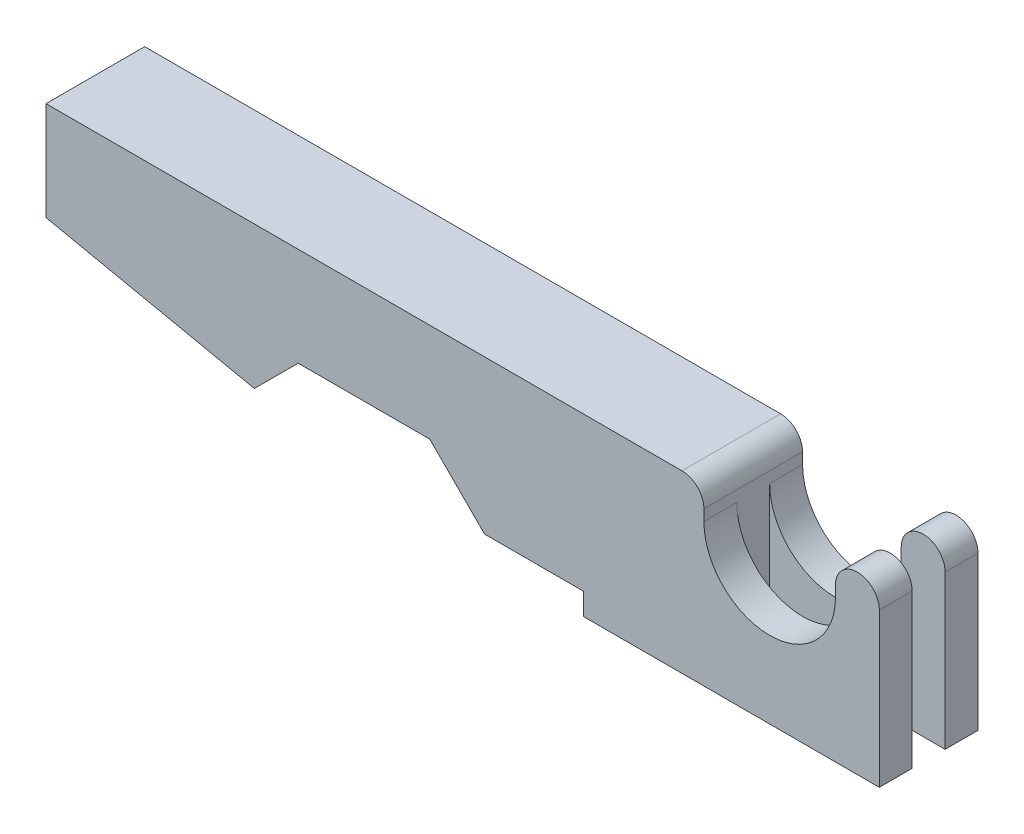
ISO-10303-21;
HEADER;
FILE_DESCRIPTION(('STEP AP214'),'2;1');
FILE_NAME('part.step','',(''),(''),'','','');
FILE_SCHEMA(('AUTOMOTIVE_DESIGN { 1 0 10303 214 1 1 1 1 }'));
ENDSEC;
DATA;
#1=APPLICATION_CONTEXT('core data for automotive mechanical design processes');
#2=APPLICATION_PROTOCOL_DEFINITION('international standard','automotive_design',2000,#1);
#3=PRODUCT_CONTEXT('',#1,'mechanical');
#4=PRODUCT('Part','Part','',(#3));
#5=PRODUCT_RELATED_PRODUCT_CATEGORY('part','',(#4));
#6=PRODUCT_DEFINITION_FORMATION('','',#4);
#7=PRODUCT_DEFINITION_CONTEXT('part definition',#1,'design');
#8=PRODUCT_DEFINITION('design','',#6,#7);
#9=PRODUCT_DEFINITION_SHAPE('','',#8);
#10=(LENGTH_UNIT() NAMED_UNIT(*) SI_UNIT(.MILLI.,.METRE.));
#11=(NAMED_UNIT(*) PLANE_ANGLE_UNIT() SI_UNIT($,.RADIAN.));
#12=(NAMED_UNIT(*) SI_UNIT($,.STERADIAN.) SOLID_ANGLE_UNIT());
#13=UNCERTAINTY_MEASURE_WITH_UNIT(LENGTH_MEASURE(1.E-05),#10,'distance_accuracy_value','');
#14=(GEOMETRIC_REPRESENTATION_CONTEXT(3) GLOBAL_UNCERTAINTY_ASSIGNED_CONTEXT((#13)) GLOBAL_UNIT_ASSIGNED_CONTEXT((#10,
#11,#12)) REPRESENTATION_CONTEXT('',''));
#15=CARTESIAN_POINT('',(0.,0.,0.));
#16=DIRECTION('',(0.,0.,1.));
#17=DIRECTION('',(1.,0.,0.));
#18=AXIS2_PLACEMENT_3D('',#15,#16,#17);
#19=CARTESIAN_POINT('',(0.,0.,2.25));
#20=DIRECTION('',(-1.,0.,0.));
#21=DIRECTION('',(0.,0.,1.));
#22=AXIS2_PLACEMENT_3D('',#19,#20,#21);
#23=PLANE('',#22);
#24=DIRECTION('',(0.,0.,-1.));
#25=VECTOR('',#24,1.);
#26=CARTESIAN_POINT('',(0.,7.,2.25));
#27=LINE('',#26,#25);
#28=CARTESIAN_POINT('',(0.,7.,-0.75));
#29=VERTEX_POINT('',#28);
#30=CARTESIAN_POINT('',(0.,7.,-2.25));
#31=VERTEX_POINT('',#30);
#32=EDGE_CURVE('E216',#29,#31,#27,.T.);
#33=ORIENTED_EDGE('',*,*,#32,.F.);
#34=DIRECTION('',(0.,-1.,0.));
#35=VECTOR('',#34,1.);
#36=CARTESIAN_POINT('',(0.,8.,-0.75));
#37=LINE('',#36,#35);
#38=CARTESIAN_POINT('',(0.,0.,-0.75));
#39=VERTEX_POINT('',#38);
#40=EDGE_CURVE('E327',#29,#39,#37,.T.);
#41=ORIENTED_EDGE('',*,*,#40,.T.);
#42=DIRECTION('',(0.,0.,-1.));
#43=VECTOR('',#42,1.);
#44=CARTESIAN_POINT('',(0.,0.,2.25));
#45=LINE('',#44,#43);
#46=CARTESIAN_POINT('',(0.,0.,-2.25));
#47=VERTEX_POINT('',#46);
#48=EDGE_CURVE('E208',#39,#47,#45,.T.);
#49=ORIENTED_EDGE('',*,*,#48,.T.);
#50=DIRECTION('',(0.,1.,0.));
#51=VECTOR('',#50,1.);
#52=CARTESIAN_POINT('',(0.,0.,-2.25));
#53=LINE('',#52,#51);
#54=EDGE_CURVE('E282',#47,#31,#53,.T.);
#55=ORIENTED_EDGE('',*,*,#54,.T.);
#56=EDGE_LOOP('',(#33,#41,#49,#55));
#57=FACE_BOUND('',#56,.T.);
#58=ADVANCED_FACE('F37',(#57),#23,.F.);
#59=CARTESIAN_POINT('',(-1.,7.,2.25));
#60=DIRECTION('',(0.,0.,-1.));
#61=DIRECTION('',(-1.,0.,0.));
#62=AXIS2_PLACEMENT_3D('',#59,#60,#61);
#63=CYLINDRICAL_SURFACE('',#62,1.);
#64=CARTESIAN_POINT('',(-1.,7.,-0.75));
#65=DIRECTION('',(0.,0.,-1.));
#66=DIRECTION('',(-1.,0.,0.));
#67=AXIS2_PLACEMENT_3D('',#64,#65,#66);
#68=CIRCLE('',#67,1.);
#69=CARTESIAN_POINT('',(-2.,7.,-0.750000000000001));
#70=VERTEX_POINT('',#69);
#71=EDGE_CURVE('E288',#70,#29,#68,.T.);
#72=ORIENTED_EDGE('',*,*,#71,.T.);
#73=ORIENTED_EDGE('',*,*,#32,.T.);
#74=CARTESIAN_POINT('',(-1.,7.,-2.25));
#75=DIRECTION('',(0.,0.,1.));
#76=DIRECTION('',(1.,0.,0.));
#77=AXIS2_PLACEMENT_3D('',#74,#75,#76);
#78=CIRCLE('',#77,1.);
#79=CARTESIAN_POINT('',(-2.,7.,-2.25));
#80=VERTEX_POINT('',#79);
#81=EDGE_CURVE('E279',#31,#80,#78,.T.);
#82=ORIENTED_EDGE('',*,*,#81,.T.);
#83=DIRECTION('',(0.,0.,-1.));
#84=VECTOR('',#83,1.);
#85=CARTESIAN_POINT('',(-2.,7.,2.25));
#86=LINE('',#85,#84);
#87=EDGE_CURVE('E220',#70,#80,#86,.T.);
#88=ORIENTED_EDGE('',*,*,#87,.F.);
#89=EDGE_LOOP('',(#72,#73,#82,#88));
#90=FACE_BOUND('',#89,.T.);
#91=ADVANCED_FACE('F346',(#90),#63,.T.);
#92=CARTESIAN_POINT('',(-2.,7.,2.25));
#93=DIRECTION('',(1.,0.,0.));
#94=DIRECTION('',(0.,1.,0.));
#95=AXIS2_PLACEMENT_3D('',#92,#93,#94);
#96=PLANE('',#95);
#97=DIRECTION('',(0.,0.,-1.));
#98=VECTOR('',#97,1.);
#99=CARTESIAN_POINT('',(-2.,6.5,2.25));
#100=LINE('',#99,#98);
#101=CARTESIAN_POINT('',(-2.,6.5,-0.75));
#102=VERTEX_POINT('',#101);
#103=CARTESIAN_POINT('',(-2.,6.5,-2.25));
#104=VERTEX_POINT('',#103);
#105=EDGE_CURVE('E224',#102,#104,#100,.T.);
#106=ORIENTED_EDGE('',*,*,#105,.F.);
#107=DIRECTION('',(0.,1.,0.));
#108=VECTOR('',#107,1.);
#109=CARTESIAN_POINT('',(-2.,7.,-0.750000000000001));
#110=LINE('',#109,#108);
#111=EDGE_CURVE('E315',#102,#70,#110,.T.);
#112=ORIENTED_EDGE('',*,*,#111,.T.);
#113=ORIENTED_EDGE('',*,*,#87,.T.);
#114=DIRECTION('',(0.,-1.,0.));
#115=VECTOR('',#114,1.);
#116=CARTESIAN_POINT('',(-2.,7.,-2.25));
#117=LINE('',#116,#115);
#118=EDGE_CURVE('E276',#80,#104,#117,.T.);
#119=ORIENTED_EDGE('',*,*,#118,.T.);
#120=EDGE_LOOP('',(#106,#112,#113,#119));
#121=FACE_BOUND('',#120,.T.);
#122=ADVANCED_FACE('F351',(#121),#96,.F.);
#123=CARTESIAN_POINT('',(-5.,6.5,2.25));
#124=DIRECTION('',(0.,0.,-1.));
#125=DIRECTION('',(-1.,0.,0.));
#126=AXIS2_PLACEMENT_3D('',#123,#124,#125);
#127=CYLINDRICAL_SURFACE('',#126,3.);
#128=DIRECTION('',(0.,0.,-1.));
#129=VECTOR('',#128,1.);
#130=CARTESIAN_POINT('',(-8.,6.5,2.25));
#131=LINE('',#130,#129);
#132=CARTESIAN_POINT('',(-8.,6.5,-0.750000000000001));
#133=VERTEX_POINT('',#132);
#134=CARTESIAN_POINT('',(-8.,6.5,-2.25));
#135=VERTEX_POINT('',#134);
#136=EDGE_CURVE('E228',#133,#135,#131,.T.);
#137=ORIENTED_EDGE('',*,*,#136,.F.);
#138=CARTESIAN_POINT('',(-5.,6.5,-0.750000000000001));
#139=DIRECTION('',(0.,0.,-1.));
#140=DIRECTION('',(-1.,0.,0.));
#141=AXIS2_PLACEMENT_3D('',#138,#139,#140);
#142=CIRCLE('',#141,3.);
#143=EDGE_CURVE('E318',#133,#102,#142,.F.);
#144=ORIENTED_EDGE('',*,*,#143,.T.);
#145=ORIENTED_EDGE('',*,*,#105,.T.);
#146=CARTESIAN_POINT('',(-5.,6.5,-2.25));
#147=DIRECTION('',(0.,0.,-1.));
#148=DIRECTION('',(1.,0.,0.));
#149=AXIS2_PLACEMENT_3D('',#146,#147,#148);
#150=CIRCLE('',#149,3.);
#151=EDGE_CURVE('E273',#104,#135,#150,.T.);
#152=ORIENTED_EDGE('',*,*,#151,.T.);
#153=EDGE_LOOP('',(#137,#144,#145,#152));
#154=FACE_BOUND('',#153,.T.);
#155=ADVANCED_FACE('F354',(#154),#127,.F.);
#156=CARTESIAN_POINT('',(-13.5,0.,2.25));
#157=DIRECTION('',(0.,1.,0.));
#158=DIRECTION('',(0.,0.,1.));
#159=AXIS2_PLACEMENT_3D('',#156,#157,#158);
#160=PLANE('',#159);
#161=ORIENTED_EDGE('',*,*,#48,.F.);
#162=DIRECTION('',(1.,0.,0.));
#163=VECTOR('',#162,1.);
#164=CARTESIAN_POINT('',(0.,0.,-0.75));
#165=LINE('',#164,#163);
#166=CARTESIAN_POINT('',(-8.,0.,-0.750000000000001));
#167=VERTEX_POINT('',#166);
#168=EDGE_CURVE('E192',#167,#39,#165,.T.);
#169=ORIENTED_EDGE('',*,*,#168,.F.);
#170=DIRECTION('',(0.,0.,-1.));
#171=VECTOR('',#170,1.);
#172=CARTESIAN_POINT('',(-8.,0.,0.749999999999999));
#173=LINE('',#172,#171);
#174=CARTESIAN_POINT('',(-8.,0.,0.749999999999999));
#175=VERTEX_POINT('',#174);
#176=EDGE_CURVE('E202',#175,#167,#173,.T.);
#177=ORIENTED_EDGE('',*,*,#176,.F.);
#178=DIRECTION('',(-1.,0.,0.));
#179=VECTOR('',#178,1.);
#180=CARTESIAN_POINT('',(0.,0.,0.75));
#181=LINE('',#180,#179);
#182=CARTESIAN_POINT('',(0.,0.,0.75));
#183=VERTEX_POINT('',#182);
#184=EDGE_CURVE('E183',#183,#175,#181,.T.);
#185=ORIENTED_EDGE('',*,*,#184,.F.);
#186=CARTESIAN_POINT('',(0.,0.,2.25));
#187=VERTEX_POINT('',#186);
#188=EDGE_CURVE('E199',#187,#183,#45,.T.);
#189=ORIENTED_EDGE('',*,*,#188,.F.);
#190=DIRECTION('',(1.,0.,0.));
#191=VECTOR('',#190,1.);
#192=CARTESIAN_POINT('',(-13.5,0.,2.25));
#193=LINE('',#192,#191);
#194=CARTESIAN_POINT('',(-13.5,0.,2.25));
#195=VERTEX_POINT('',#194);
#196=EDGE_CURVE('E256',#195,#187,#193,.T.);
#197=ORIENTED_EDGE('',*,*,#196,.F.);
#198=DIRECTION('',(0.,0.,-1.));
#199=VECTOR('',#198,1.);
#200=CARTESIAN_POINT('',(-13.5,0.,2.25));
#201=LINE('',#200,#199);
#202=CARTESIAN_POINT('',(-13.5,0.,-2.25));
#203=VERTEX_POINT('',#202);
#204=EDGE_CURVE('E250',#195,#203,#201,.T.);
#205=ORIENTED_EDGE('',*,*,#204,.T.);
#206=DIRECTION('',(1.,0.,0.));
#207=VECTOR('',#206,1.);
#208=CARTESIAN_POINT('',(-13.5,0.,-2.25));
#209=LINE('',#208,#207);
#210=EDGE_CURVE('E285',#203,#47,#209,.T.);
#211=ORIENTED_EDGE('',*,*,#210,.T.);
#212=EDGE_LOOP('',(#161,#169,#177,#185,#189,#197,#205,#211));
#213=FACE_BOUND('',#212,.T.);
#214=ADVANCED_FACE('F197',(#213),#160,.F.);
#215=ORIENTED_EDGE('',*,*,#188,.T.);
#216=DIRECTION('',(0.,-1.,0.));
#217=VECTOR('',#216,1.);
#218=CARTESIAN_POINT('',(0.,8.,0.75));
#219=LINE('',#218,#217);
#220=CARTESIAN_POINT('',(0.,7.,0.75));
#221=VERTEX_POINT('',#220);
#222=EDGE_CURVE('E180',#221,#183,#219,.T.);
#223=ORIENTED_EDGE('',*,*,#222,.F.);
#224=CARTESIAN_POINT('',(0.,7.,2.25));
#225=VERTEX_POINT('',#224);
#226=EDGE_CURVE('E212',#225,#221,#27,.T.);
#227=ORIENTED_EDGE('',*,*,#226,.F.);
#228=DIRECTION('',(0.,1.,0.));
#229=VECTOR('',#228,1.);
#230=CARTESIAN_POINT('',(0.,0.,2.25));
#231=LINE('',#230,#229);
#232=EDGE_CURVE('E205',#187,#225,#231,.T.);
#233=ORIENTED_EDGE('',*,*,#232,.F.);
#234=EDGE_LOOP('',(#215,#223,#227,#233));
#235=FACE_BOUND('',#234,.T.);
#236=ADVANCED_FACE('F204',(#235),#23,.F.);
#237=ORIENTED_EDGE('',*,*,#226,.T.);
#238=CARTESIAN_POINT('',(-1.,7.,0.75));
#239=DIRECTION('',(0.,0.,1.));
#240=DIRECTION('',(1.,0.,0.));
#241=AXIS2_PLACEMENT_3D('',#238,#239,#240);
#242=CIRCLE('',#241,1.);
#243=CARTESIAN_POINT('',(-2.,7.,0.75));
#244=VERTEX_POINT('',#243);
#245=EDGE_CURVE('E186',#221,#244,#242,.T.);
#246=ORIENTED_EDGE('',*,*,#245,.T.);
#247=CARTESIAN_POINT('',(-2.,7.,2.25));
#248=VERTEX_POINT('',#247);
#249=EDGE_CURVE('E217',#248,#244,#86,.T.);
#250=ORIENTED_EDGE('',*,*,#249,.F.);
#251=CARTESIAN_POINT('',(-1.,7.,2.25));
#252=DIRECTION('',(0.,0.,1.));
#253=DIRECTION('',(1.,0.,0.));
#254=AXIS2_PLACEMENT_3D('',#251,#252,#253);
#255=CIRCLE('',#254,1.);
#256=EDGE_CURVE('E310',#225,#248,#255,.T.);
#257=ORIENTED_EDGE('',*,*,#256,.F.);
#258=EDGE_LOOP('',(#237,#246,#250,#257));
#259=FACE_BOUND('',#258,.T.);
#260=ADVANCED_FACE('F416',(#259),#63,.T.);
#261=ORIENTED_EDGE('',*,*,#249,.T.);
#262=DIRECTION('',(0.,-1.,0.));
#263=VECTOR('',#262,1.);
#264=CARTESIAN_POINT('',(-2.,7.,0.75));
#265=LINE('',#264,#263);
#266=CARTESIAN_POINT('',(-2.,6.5,0.75));
#267=VERTEX_POINT('',#266);
#268=EDGE_CURVE('E322',#244,#267,#265,.T.);
#269=ORIENTED_EDGE('',*,*,#268,.T.);
#270=CARTESIAN_POINT('',(-2.,6.5,2.25));
#271=VERTEX_POINT('',#270);
#272=EDGE_CURVE('E221',#271,#267,#100,.T.);
#273=ORIENTED_EDGE('',*,*,#272,.F.);
#274=DIRECTION('',(0.,-1.,0.));
#275=VECTOR('',#274,1.);
#276=CARTESIAN_POINT('',(-2.,7.,2.25));
#277=LINE('',#276,#275);
#278=EDGE_CURVE('E308',#248,#271,#277,.T.);
#279=ORIENTED_EDGE('',*,*,#278,.F.);
#280=EDGE_LOOP('',(#261,#269,#273,#279));
#281=FACE_BOUND('',#280,.T.);
#282=ADVANCED_FACE('F422',(#281),#96,.F.);
#283=ORIENTED_EDGE('',*,*,#272,.T.);
#284=CARTESIAN_POINT('',(-5.,6.5,0.749999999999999));
#285=DIRECTION('',(0.,0.,1.));
#286=DIRECTION('',(1.,0.,0.));
#287=AXIS2_PLACEMENT_3D('',#284,#285,#286);
#288=CIRCLE('',#287,3.);
#289=CARTESIAN_POINT('',(-8.,6.5,0.749999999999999));
#290=VERTEX_POINT('',#289);
#291=EDGE_CURVE('E325',#267,#290,#288,.F.);
#292=ORIENTED_EDGE('',*,*,#291,.T.);
#293=CARTESIAN_POINT('',(-8.,6.5,2.25));
#294=VERTEX_POINT('',#293);
#295=EDGE_CURVE('E225',#294,#290,#131,.T.);
#296=ORIENTED_EDGE('',*,*,#295,.F.);
#297=CARTESIAN_POINT('',(-5.,6.5,2.25));
#298=DIRECTION('',(0.,0.,-1.));
#299=DIRECTION('',(1.,0.,0.));
#300=AXIS2_PLACEMENT_3D('',#297,#298,#299);
#301=CIRCLE('',#300,3.);
#302=EDGE_CURVE('E306',#271,#294,#301,.T.);
#303=ORIENTED_EDGE('',*,*,#302,.F.);
#304=EDGE_LOOP('',(#283,#292,#296,#303));
#305=FACE_BOUND('',#304,.T.);
#306=ADVANCED_FACE('F428',(#305),#127,.F.);
#307=CARTESIAN_POINT('',(-8.,8.,2.25));
#308=DIRECTION('',(-1.,0.,0.));
#309=DIRECTION('',(0.,0.,1.));
#310=AXIS2_PLACEMENT_3D('',#307,#308,#309);
#311=PLANE('',#310);
#312=DIRECTION('',(0.,1.,0.));
#313=VECTOR('',#312,1.);
#314=CARTESIAN_POINT('',(-8.,8.,-2.25));
#315=LINE('',#314,#313);
#316=CARTESIAN_POINT('',(-8.,7.,-2.25));
#317=VERTEX_POINT('',#316);
#318=EDGE_CURVE('E271',#135,#317,#315,.T.);
#319=ORIENTED_EDGE('',*,*,#318,.T.);
#320=DIRECTION('',(0.,0.,-1.));
#321=VECTOR('',#320,1.);
#322=CARTESIAN_POINT('',(-8.,7.,2.25));
#323=LINE('',#322,#321);
#324=CARTESIAN_POINT('',(-8.,7.,2.25));
#325=VERTEX_POINT('',#324);
#326=EDGE_CURVE('E45',#317,#325,#323,.F.);
#327=ORIENTED_EDGE('',*,*,#326,.T.);
#328=DIRECTION('',(0.,1.,0.));
#329=VECTOR('',#328,1.);
#330=CARTESIAN_POINT('',(-8.,8.,2.25));
#331=LINE('',#330,#329);
#332=EDGE_CURVE('E304',#294,#325,#331,.T.);
#333=ORIENTED_EDGE('',*,*,#332,.F.);
#334=ORIENTED_EDGE('',*,*,#295,.T.);
#335=DIRECTION('',(0.,-1.,0.));
#336=VECTOR('',#335,1.);
#337=CARTESIAN_POINT('',(-8.,8.,0.749999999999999));
#338=LINE('',#337,#336);
#339=EDGE_CURVE('E191',#290,#175,#338,.T.);
#340=ORIENTED_EDGE('',*,*,#339,.T.);
#341=ORIENTED_EDGE('',*,*,#176,.T.);
#342=DIRECTION('',(0.,-1.,0.));
#343=VECTOR('',#342,1.);
#344=CARTESIAN_POINT('',(-8.,8.,-0.750000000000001));
#345=LINE('',#344,#343);
#346=EDGE_CURVE('E330',#133,#167,#345,.T.);
#347=ORIENTED_EDGE('',*,*,#346,.F.);
#348=ORIENTED_EDGE('',*,*,#136,.T.);
#349=EDGE_LOOP('',(#319,#327,#333,#334,#340,#341,#347,#348));
#350=FACE_BOUND('',#349,.T.);
#351=ADVANCED_FACE('F336',(#350),#311,.F.);
#352=CARTESIAN_POINT('',(-8.,8.,2.25));
#353=DIRECTION('',(0.,-1.,0.));
#354=DIRECTION('',(1.,0.,0.));
#355=AXIS2_PLACEMENT_3D('',#352,#353,#354);
#356=PLANE('',#355);
#357=DIRECTION('',(-1.,0.,0.));
#358=VECTOR('',#357,1.);
#359=CARTESIAN_POINT('',(-8.,8.,2.25));
#360=LINE('',#359,#358);
#361=CARTESIAN_POINT('',(-9.,8.,2.25));
#362=VERTEX_POINT('',#361);
#363=CARTESIAN_POINT('',(-38.,8.,2.25));
#364=VERTEX_POINT('',#363);
#365=EDGE_CURVE('E302',#362,#364,#360,.T.);
#366=ORIENTED_EDGE('',*,*,#365,.F.);
#367=DIRECTION('',(0.,0.,-1.));
#368=VECTOR('',#367,1.);
#369=CARTESIAN_POINT('',(-9.,8.,2.25));
#370=LINE('',#369,#368);
#371=CARTESIAN_POINT('',(-9.,8.,-2.25));
#372=VERTEX_POINT('',#371);
#373=EDGE_CURVE('E207',#362,#372,#370,.T.);
#374=ORIENTED_EDGE('',*,*,#373,.T.);
#375=DIRECTION('',(-1.,0.,0.));
#376=VECTOR('',#375,1.);
#377=CARTESIAN_POINT('',(-8.,8.,-2.25));
#378=LINE('',#377,#376);
#379=CARTESIAN_POINT('',(-38.,8.,-2.25));
#380=VERTEX_POINT('',#379);
#381=EDGE_CURVE('E269',#372,#380,#378,.T.);
#382=ORIENTED_EDGE('',*,*,#381,.T.);
#383=DIRECTION('',(0.,0.,-1.));
#384=VECTOR('',#383,1.);
#385=CARTESIAN_POINT('',(-38.,8.,2.25));
#386=LINE('',#385,#384);
#387=EDGE_CURVE('E229',#364,#380,#386,.T.);
#388=ORIENTED_EDGE('',*,*,#387,.F.);
#389=EDGE_LOOP('',(#366,#374,#382,#388));
#390=FACE_BOUND('',#389,.T.);
#391=ADVANCED_FACE('F363',(#390),#356,.F.);
#392=CARTESIAN_POINT('',(-38.,8.,2.25));
#393=DIRECTION('',(1.,0.,0.));
#394=DIRECTION('',(0.,0.,-1.));
#395=AXIS2_PLACEMENT_3D('',#392,#393,#394);
#396=PLANE('',#395);
#397=DIRECTION('',(0.,-1.,0.));
#398=VECTOR('',#397,1.);
#399=CARTESIAN_POINT('',(-38.,8.,-2.25));
#400=LINE('',#399,#398);
#401=CARTESIAN_POINT('',(-38.,3.5,-2.25));
#402=VERTEX_POINT('',#401);
#403=EDGE_CURVE('E267',#380,#402,#400,.T.);
#404=ORIENTED_EDGE('',*,*,#403,.T.);
#405=DIRECTION('',(0.,0.,-1.));
#406=VECTOR('',#405,1.);
#407=CARTESIAN_POINT('',(-38.,3.5,2.25));
#408=LINE('',#407,#406);
#409=CARTESIAN_POINT('',(-38.,3.5,2.25));
#410=VERTEX_POINT('',#409);
#411=EDGE_CURVE('E232',#410,#402,#408,.T.);
#412=ORIENTED_EDGE('',*,*,#411,.F.);
#413=DIRECTION('',(0.,-1.,0.));
#414=VECTOR('',#413,1.);
#415=CARTESIAN_POINT('',(-38.,8.,2.25));
#416=LINE('',#415,#414);
#417=EDGE_CURVE('E300',#364,#410,#416,.T.);
#418=ORIENTED_EDGE('',*,*,#417,.F.);
#419=ORIENTED_EDGE('',*,*,#387,.T.);
#420=EDGE_LOOP('',(#404,#412,#418,#419));
#421=FACE_BOUND('',#420,.T.);
#422=ADVANCED_FACE('F368',(#421),#396,.F.);
#423=CARTESIAN_POINT('',(-38.,3.5,2.25));
#424=DIRECTION('',(0.206010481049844,0.978549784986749,0.));
#425=DIRECTION('',(-0.978549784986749,0.206010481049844,0.));
#426=AXIS2_PLACEMENT_3D('',#423,#424,#425);
#427=PLANE('',#426);
#428=DIRECTION('',(0.978549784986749,-0.206010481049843,0.));
#429=VECTOR('',#428,1.);
#430=CARTESIAN_POINT('',(-38.,3.5,-2.25));
#431=LINE('',#430,#429);
#432=CARTESIAN_POINT('',(-28.5,1.49999999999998,-2.25));
#433=VERTEX_POINT('',#432);
#434=EDGE_CURVE('E265',#402,#433,#431,.T.);
#435=ORIENTED_EDGE('',*,*,#434,.T.);
#436=DIRECTION('',(0.,0.,-1.));
#437=VECTOR('',#436,1.);
#438=CARTESIAN_POINT('',(-28.5,1.49999999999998,2.25));
#439=LINE('',#438,#437);
#440=CARTESIAN_POINT('',(-28.5,1.49999999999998,2.25));
#441=VERTEX_POINT('',#440);
#442=EDGE_CURVE('E235',#441,#433,#439,.T.);
#443=ORIENTED_EDGE('',*,*,#442,.F.);
#444=DIRECTION('',(0.978549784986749,-0.206010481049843,0.));
#445=VECTOR('',#444,1.);
#446=CARTESIAN_POINT('',(-38.,3.5,2.25));
#447=LINE('',#446,#445);
#448=EDGE_CURVE('E298',#410,#441,#447,.T.);
#449=ORIENTED_EDGE('',*,*,#448,.F.);
#450=ORIENTED_EDGE('',*,*,#411,.T.);
#451=EDGE_LOOP('',(#435,#443,#449,#450));
#452=FACE_BOUND('',#451,.T.);
#453=ADVANCED_FACE('F374',(#452),#427,.F.);
#454=CARTESIAN_POINT('',(-28.5,1.49999999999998,2.25));
#455=DIRECTION('',(-0.707106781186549,0.707106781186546,0.));
#456=DIRECTION('',(-0.707106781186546,-0.707106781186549,0.));
#457=AXIS2_PLACEMENT_3D('',#454,#455,#456);
#458=PLANE('',#457);
#459=DIRECTION('',(0.707106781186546,0.707106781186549,0.));
#460=VECTOR('',#459,1.);
#461=CARTESIAN_POINT('',(-28.5,1.49999999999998,-2.25));
#462=LINE('',#461,#460);
#463=CARTESIAN_POINT('',(-26.5,3.5,-2.25));
#464=VERTEX_POINT('',#463);
#465=EDGE_CURVE('E263',#433,#464,#462,.T.);
#466=ORIENTED_EDGE('',*,*,#465,.T.);
#467=DIRECTION('',(0.,0.,-1.));
#468=VECTOR('',#467,1.);
#469=CARTESIAN_POINT('',(-26.5,3.5,2.25));
#470=LINE('',#469,#468);
#471=CARTESIAN_POINT('',(-26.5,3.5,2.25));
#472=VERTEX_POINT('',#471);
#473=EDGE_CURVE('E238',#472,#464,#470,.T.);
#474=ORIENTED_EDGE('',*,*,#473,.F.);
#475=DIRECTION('',(0.707106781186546,0.707106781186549,0.));
#476=VECTOR('',#475,1.);
#477=CARTESIAN_POINT('',(-28.5,1.49999999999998,2.25));
#478=LINE('',#477,#476);
#479=EDGE_CURVE('E296',#441,#472,#478,.T.);
#480=ORIENTED_EDGE('',*,*,#479,.F.);
#481=ORIENTED_EDGE('',*,*,#442,.T.);
#482=EDGE_LOOP('',(#466,#474,#480,#481));
#483=FACE_BOUND('',#482,.T.);
#484=ADVANCED_FACE('F378',(#483),#458,.F.);
#485=CARTESIAN_POINT('',(-26.5,3.5,2.25));
#486=DIRECTION('',(0.,1.,0.));
#487=DIRECTION('',(-1.,0.,0.));
#488=AXIS2_PLACEMENT_3D('',#485,#486,#487);
#489=PLANE('',#488);
#490=DIRECTION('',(1.,0.,0.));
#491=VECTOR('',#490,1.);
#492=CARTESIAN_POINT('',(-26.5,3.5,-2.25));
#493=LINE('',#492,#491);
#494=CARTESIAN_POINT('',(-20.5,3.5,-2.25));
#495=VERTEX_POINT('',#494);
#496=EDGE_CURVE('E261',#464,#495,#493,.T.);
#497=ORIENTED_EDGE('',*,*,#496,.T.);
#498=DIRECTION('',(0.,0.,-1.));
#499=VECTOR('',#498,1.);
#500=CARTESIAN_POINT('',(-20.5,3.5,2.25));
#501=LINE('',#500,#499);
#502=CARTESIAN_POINT('',(-20.5,3.5,2.25));
#503=VERTEX_POINT('',#502);
#504=EDGE_CURVE('E241',#503,#495,#501,.T.);
#505=ORIENTED_EDGE('',*,*,#504,.F.);
#506=DIRECTION('',(1.,0.,0.));
#507=VECTOR('',#506,1.);
#508=CARTESIAN_POINT('',(-26.5,3.5,2.25));
#509=LINE('',#508,#507);
#510=EDGE_CURVE('E294',#472,#503,#509,.T.);
#511=ORIENTED_EDGE('',*,*,#510,.F.);
#512=ORIENTED_EDGE('',*,*,#473,.T.);
#513=EDGE_LOOP('',(#497,#505,#511,#512));
#514=FACE_BOUND('',#513,.T.);
#515=ADVANCED_FACE('F383',(#514),#489,.F.);
#516=CARTESIAN_POINT('',(-20.5,3.5,2.25));
#517=DIRECTION('',(0.707106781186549,0.707106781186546,0.));
#518=DIRECTION('',(-0.707106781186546,0.707106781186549,0.));
#519=AXIS2_PLACEMENT_3D('',#516,#517,#518);
#520=PLANE('',#519);
#521=DIRECTION('',(0.707106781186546,-0.707106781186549,0.));
#522=VECTOR('',#521,1.);
#523=CARTESIAN_POINT('',(-20.5,3.5,-2.25));
#524=LINE('',#523,#522);
#525=CARTESIAN_POINT('',(-18.,1.,-2.25));
#526=VERTEX_POINT('',#525);
#527=EDGE_CURVE('E259',#495,#526,#524,.T.);
#528=ORIENTED_EDGE('',*,*,#527,.T.);
#529=DIRECTION('',(0.,0.,-1.));
#530=VECTOR('',#529,1.);
#531=CARTESIAN_POINT('',(-18.,1.,2.25));
#532=LINE('',#531,#530);
#533=CARTESIAN_POINT('',(-18.,1.,2.25));
#534=VERTEX_POINT('',#533);
#535=EDGE_CURVE('E244',#534,#526,#532,.T.);
#536=ORIENTED_EDGE('',*,*,#535,.F.);
#537=DIRECTION('',(0.707106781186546,-0.707106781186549,0.));
#538=VECTOR('',#537,1.);
#539=CARTESIAN_POINT('',(-20.5,3.5,2.25));
#540=LINE('',#539,#538);
#541=EDGE_CURVE('E292',#503,#534,#540,.T.);
#542=ORIENTED_EDGE('',*,*,#541,.F.);
#543=ORIENTED_EDGE('',*,*,#504,.T.);
#544=EDGE_LOOP('',(#528,#536,#542,#543));
#545=FACE_BOUND('',#544,.T.);
#546=ADVANCED_FACE('F389',(#545),#520,.F.);
#547=CARTESIAN_POINT('',(-18.,1.,2.25));
#548=DIRECTION('',(0.,1.,0.));
#549=DIRECTION('',(0.,0.,1.));
#550=AXIS2_PLACEMENT_3D('',#547,#548,#549);
#551=PLANE('',#550);
#552=DIRECTION('',(1.,0.,0.));
#553=VECTOR('',#552,1.);
#554=CARTESIAN_POINT('',(-18.,1.,-2.25));
#555=LINE('',#554,#553);
#556=CARTESIAN_POINT('',(-13.5,1.,-2.25));
#557=VERTEX_POINT('',#556);
#558=EDGE_CURVE('E257',#526,#557,#555,.T.);
#559=ORIENTED_EDGE('',*,*,#558,.T.);
#560=DIRECTION('',(0.,0.,-1.));
#561=VECTOR('',#560,1.);
#562=CARTESIAN_POINT('',(-13.5,1.,2.25));
#563=LINE('',#562,#561);
#564=CARTESIAN_POINT('',(-13.5,1.,2.25));
#565=VERTEX_POINT('',#564);
#566=EDGE_CURVE('E247',#565,#557,#563,.T.);
#567=ORIENTED_EDGE('',*,*,#566,.F.);
#568=DIRECTION('',(1.,0.,0.));
#569=VECTOR('',#568,1.);
#570=CARTESIAN_POINT('',(-18.,1.,2.25));
#571=LINE('',#570,#569);
#572=EDGE_CURVE('E290',#534,#565,#571,.T.);
#573=ORIENTED_EDGE('',*,*,#572,.F.);
#574=ORIENTED_EDGE('',*,*,#535,.T.);
#575=EDGE_LOOP('',(#559,#567,#573,#574));
#576=FACE_BOUND('',#575,.T.);
#577=ADVANCED_FACE('F393',(#576),#551,.F.);
#578=CARTESIAN_POINT('',(-13.5,1.,2.25));
#579=DIRECTION('',(1.,0.,0.));
#580=DIRECTION('',(0.,0.,-1.));
#581=AXIS2_PLACEMENT_3D('',#578,#579,#580);
#582=PLANE('',#581);
#583=DIRECTION('',(0.,-1.,0.));
#584=VECTOR('',#583,1.);
#585=CARTESIAN_POINT('',(-13.5,1.,-2.25));
#586=LINE('',#585,#584);
#587=EDGE_CURVE('E254',#557,#203,#586,.T.);
#588=ORIENTED_EDGE('',*,*,#587,.T.);
#589=ORIENTED_EDGE('',*,*,#204,.F.);
#590=DIRECTION('',(0.,-1.,0.));
#591=VECTOR('',#590,1.);
#592=CARTESIAN_POINT('',(-13.5,1.,2.25));
#593=LINE('',#592,#591);
#594=EDGE_CURVE('E253',#565,#195,#593,.T.);
#595=ORIENTED_EDGE('',*,*,#594,.F.);
#596=ORIENTED_EDGE('',*,*,#566,.T.);
#597=EDGE_LOOP('',(#588,#589,#595,#596));
#598=FACE_BOUND('',#597,.T.);
#599=ADVANCED_FACE('F398',(#598),#582,.F.);
#600=CARTESIAN_POINT('',(-1.,7.,2.25));
#601=DIRECTION('',(0.,0.,1.));
#602=DIRECTION('',(1.,0.,0.));
#603=AXIS2_PLACEMENT_3D('',#600,#601,#602);
#604=PLANE('',#603);
#605=ORIENTED_EDGE('',*,*,#332,.T.);
#606=CARTESIAN_POINT('',(-9.,7.,2.25));
#607=DIRECTION('',(0.,0.,1.));
#608=DIRECTION('',(1.,0.,0.));
#609=AXIS2_PLACEMENT_3D('',#606,#607,#608);
#610=CIRCLE('',#609,1.);
#611=EDGE_CURVE('E11',#325,#362,#610,.T.);
#612=ORIENTED_EDGE('',*,*,#611,.T.);
#613=ORIENTED_EDGE('',*,*,#365,.T.);
#614=ORIENTED_EDGE('',*,*,#417,.T.);
#615=ORIENTED_EDGE('',*,*,#448,.T.);
#616=ORIENTED_EDGE('',*,*,#479,.T.);
#617=ORIENTED_EDGE('',*,*,#510,.T.);
#618=ORIENTED_EDGE('',*,*,#541,.T.);
#619=ORIENTED_EDGE('',*,*,#572,.T.);
#620=ORIENTED_EDGE('',*,*,#594,.T.);
#621=ORIENTED_EDGE('',*,*,#196,.T.);
#622=ORIENTED_EDGE('',*,*,#232,.T.);
#623=ORIENTED_EDGE('',*,*,#256,.T.);
#624=ORIENTED_EDGE('',*,*,#278,.T.);
#625=ORIENTED_EDGE('',*,*,#302,.T.);
#626=EDGE_LOOP('',(#605,#612,#613,#614,#615,#616,#617,#618,#619,#620,#621,#622,#623,#624,#625));
#627=FACE_BOUND('',#626,.T.);
#628=ADVANCED_FACE('F360',(#627),#604,.T.);
#629=CARTESIAN_POINT('',(-1.,7.,-2.25));
#630=DIRECTION('',(0.,0.,1.));
#631=DIRECTION('',(1.,0.,0.));
#632=AXIS2_PLACEMENT_3D('',#629,#630,#631);
#633=PLANE('',#632);
#634=ORIENTED_EDGE('',*,*,#381,.F.);
#635=CARTESIAN_POINT('',(-9.,7.,-2.25));
#636=DIRECTION('',(0.,0.,1.));
#637=DIRECTION('',(1.,0.,0.));
#638=AXIS2_PLACEMENT_3D('',#635,#636,#637);
#639=CIRCLE('',#638,1.);
#640=EDGE_CURVE('E59',#372,#317,#639,.F.);
#641=ORIENTED_EDGE('',*,*,#640,.T.);
#642=ORIENTED_EDGE('',*,*,#318,.F.);
#643=ORIENTED_EDGE('',*,*,#151,.F.);
#644=ORIENTED_EDGE('',*,*,#118,.F.);
#645=ORIENTED_EDGE('',*,*,#81,.F.);
#646=ORIENTED_EDGE('',*,*,#54,.F.);
#647=ORIENTED_EDGE('',*,*,#210,.F.);
#648=ORIENTED_EDGE('',*,*,#587,.F.);
#649=ORIENTED_EDGE('',*,*,#558,.F.);
#650=ORIENTED_EDGE('',*,*,#527,.F.);
#651=ORIENTED_EDGE('',*,*,#496,.F.);
#652=ORIENTED_EDGE('',*,*,#465,.F.);
#653=ORIENTED_EDGE('',*,*,#434,.F.);
#654=ORIENTED_EDGE('',*,*,#403,.F.);
#655=EDGE_LOOP('',(#634,#641,#642,#643,#644,#645,#646,#647,#648,#649,#650,#651,#652,#653,#654));
#656=FACE_BOUND('',#655,.T.);
#657=ADVANCED_FACE('F400',(#656),#633,.F.);
#658=CARTESIAN_POINT('',(0.,8.,-0.75));
#659=DIRECTION('',(0.,0.,-1.));
#660=DIRECTION('',(-1.,0.,0.));
#661=AXIS2_PLACEMENT_3D('',#658,#659,#660);
#662=PLANE('',#661);
#663=ORIENTED_EDGE('',*,*,#71,.F.);
#664=ORIENTED_EDGE('',*,*,#111,.F.);
#665=ORIENTED_EDGE('',*,*,#143,.F.);
#666=ORIENTED_EDGE('',*,*,#346,.T.);
#667=ORIENTED_EDGE('',*,*,#168,.T.);
#668=ORIENTED_EDGE('',*,*,#40,.F.);
#669=EDGE_LOOP('',(#663,#664,#665,#666,#667,#668));
#670=FACE_BOUND('',#669,.T.);
#671=ADVANCED_FACE('F340',(#670),#662,.F.);
#672=CARTESIAN_POINT('',(0.,8.,0.75));
#673=DIRECTION('',(0.,0.,1.));
#674=DIRECTION('',(1.,0.,0.));
#675=AXIS2_PLACEMENT_3D('',#672,#673,#674);
#676=PLANE('',#675);
#677=ORIENTED_EDGE('',*,*,#222,.T.);
#678=ORIENTED_EDGE('',*,*,#184,.T.);
#679=ORIENTED_EDGE('',*,*,#339,.F.);
#680=ORIENTED_EDGE('',*,*,#291,.F.);
#681=ORIENTED_EDGE('',*,*,#268,.F.);
#682=ORIENTED_EDGE('',*,*,#245,.F.);
#683=EDGE_LOOP('',(#677,#678,#679,#680,#681,#682));
#684=FACE_BOUND('',#683,.T.);
#685=ADVANCED_FACE('F182',(#684),#676,.F.);
#686=CARTESIAN_POINT('',(-9.,7.,2.25));
#687=DIRECTION('',(0.,0.,-1.));
#688=DIRECTION('',(-1.,0.,0.));
#689=AXIS2_PLACEMENT_3D('',#686,#687,#688);
#690=CYLINDRICAL_SURFACE('',#689,1.);
#691=ORIENTED_EDGE('',*,*,#611,.F.);
#692=ORIENTED_EDGE('',*,*,#326,.F.);
#693=ORIENTED_EDGE('',*,*,#640,.F.);
#694=ORIENTED_EDGE('',*,*,#373,.F.);
#695=EDGE_LOOP('',(#691,#692,#693,#694));
#696=FACE_BOUND('',#695,.T.);
#697=ADVANCED_FACE('F39',(#696),#690,.T.);
#698=CLOSED_SHELL('',(#58,#91,#122,#155,#214,#236,#260,#282,#306,#351,#391,#422,#453,#484,#515,
#546,#577,#599,#628,#657,#671,#685,#697));
#699=MANIFOLD_SOLID_BREP('B2',#698);
#700=ADVANCED_BREP_SHAPE_REPRESENTATION('',(#18,#699),#14);
#701=SHAPE_DEFINITION_REPRESENTATION(#9,#700);
ENDSEC;
END-ISO-10303-21;
